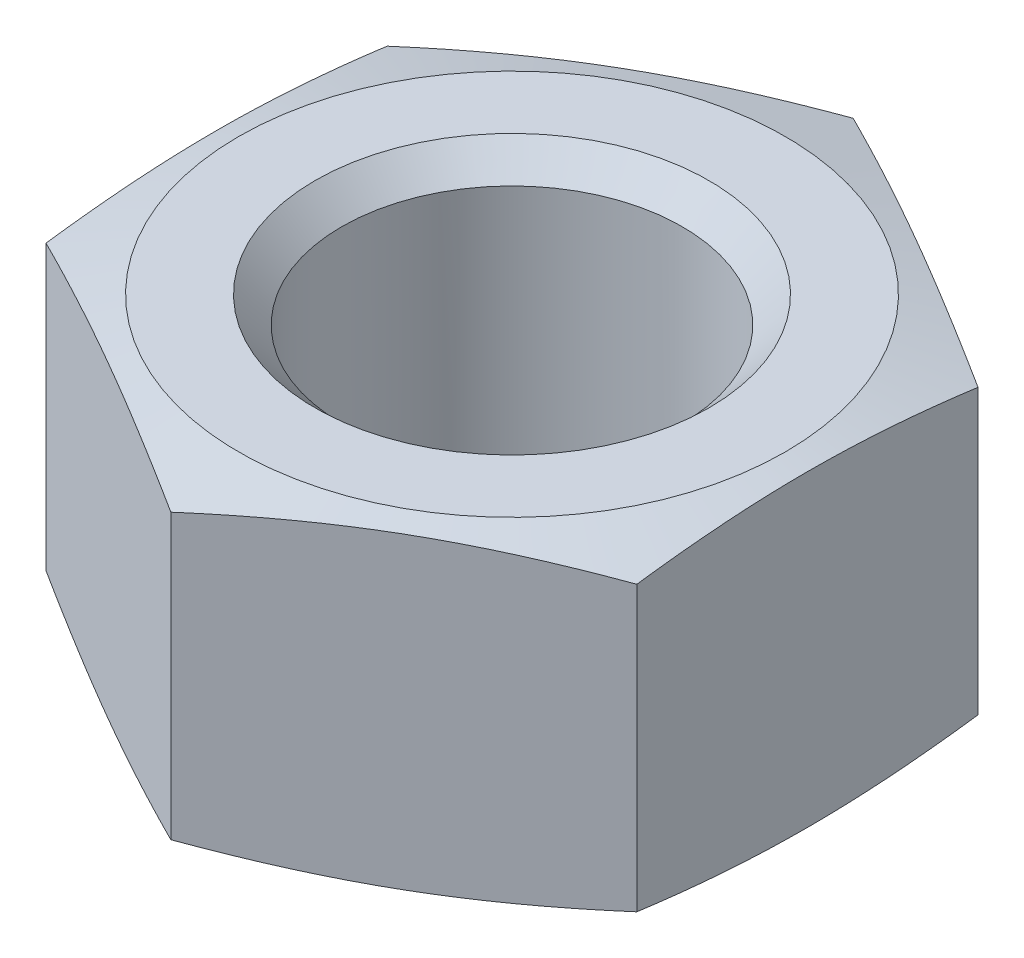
ISO-10303-21;
HEADER;
FILE_DESCRIPTION(('STEP AP214'),'2;1');
FILE_NAME('part.step','',(''),(''),'','','');
FILE_SCHEMA(('AUTOMOTIVE_DESIGN { 1 0 10303 214 1 1 1 1 }'));
ENDSEC;
DATA;
#1=APPLICATION_CONTEXT('core data for automotive mechanical design processes');
#2=APPLICATION_PROTOCOL_DEFINITION('international standard','automotive_design',2000,#1);
#3=PRODUCT_CONTEXT('',#1,'mechanical');
#4=PRODUCT('Part','Part','',(#3));
#5=PRODUCT_RELATED_PRODUCT_CATEGORY('part','',(#4));
#6=PRODUCT_DEFINITION_FORMATION('','',#4);
#7=PRODUCT_DEFINITION_CONTEXT('part definition',#1,'design');
#8=PRODUCT_DEFINITION('design','',#6,#7);
#9=PRODUCT_DEFINITION_SHAPE('','',#8);
#10=(LENGTH_UNIT() NAMED_UNIT(*) SI_UNIT(.MILLI.,.METRE.));
#11=(NAMED_UNIT(*) PLANE_ANGLE_UNIT() SI_UNIT($,.RADIAN.));
#12=(NAMED_UNIT(*) SI_UNIT($,.STERADIAN.) SOLID_ANGLE_UNIT());
#13=UNCERTAINTY_MEASURE_WITH_UNIT(LENGTH_MEASURE(1.E-05),#10,'distance_accuracy_value','');
#14=(GEOMETRIC_REPRESENTATION_CONTEXT(3) GLOBAL_UNCERTAINTY_ASSIGNED_CONTEXT((#13)) GLOBAL_UNIT_ASSIGNED_CONTEXT((#10,
#11,#12)) REPRESENTATION_CONTEXT('',''));
#15=CARTESIAN_POINT('',(0.,0.,0.));
#16=DIRECTION('',(0.,0.,1.));
#17=DIRECTION('',(1.,0.,0.));
#18=AXIS2_PLACEMENT_3D('',#15,#16,#17);
#19=CARTESIAN_POINT('',(12.,13.,-6.92820323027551));
#20=DIRECTION('',(-0.5,0.,0.866025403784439));
#21=DIRECTION('',(0.866025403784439,0.,0.5));
#22=AXIS2_PLACEMENT_3D('',#19,#20,#21);
#23=PLANE('',#22);
#24=CARTESIAN_POINT('',(11.9999999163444,12.261423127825,-6.9282032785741));
#25=CARTESIAN_POINT('',(11.5016700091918,12.3385442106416,-7.21591418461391));
#26=CARTESIAN_POINT('',(11.0024366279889,12.4085571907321,-7.50414671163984));
#27=CARTESIAN_POINT('',(10.0022069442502,12.5315631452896,-8.08162958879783));
#28=CARTESIAN_POINT('',(9.50121000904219,12.5845492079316,-8.37088030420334));
#29=CARTESIAN_POINT('',(8.50049047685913,12.670408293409,-8.94864599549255));
#30=CARTESIAN_POINT('',(8.00077464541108,12.7033836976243,-9.2371570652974));
#31=CARTESIAN_POINT('',(7.00070578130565,12.7476003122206,-9.81454709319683));
#32=CARTESIAN_POINT('',(6.50035289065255,12.758845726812,-10.1034259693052));
#33=CARTESIAN_POINT('',(5.49964710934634,12.758845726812,-10.681183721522));
#34=CARTESIAN_POINT('',(4.99929421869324,12.7476003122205,-10.9700625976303));
#35=CARTESIAN_POINT('',(3.99922535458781,12.7033836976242,-11.5474526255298));
#36=CARTESIAN_POINT('',(3.49950952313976,12.6704082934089,-11.8359636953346));
#37=CARTESIAN_POINT('',(2.49878999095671,12.5845492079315,-12.4137293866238));
#38=CARTESIAN_POINT('',(1.99779305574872,12.5315631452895,-12.7029801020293));
#39=CARTESIAN_POINT('',(0.997563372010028,12.4085571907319,-13.2804629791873));
#40=CARTESIAN_POINT('',(0.498329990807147,12.3385442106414,-13.5686955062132));
#41=CARTESIAN_POINT('',(8.36545068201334E-08,12.2614231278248,-13.8564064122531));
#42=B_SPLINE_CURVE_WITH_KNOTS('',3,(#24,#25,#26,#27,#28,#29,#30,#31,#32,#33,#34,#35,#36,#37,#38,
#39,#40,#41),.UNSPECIFIED.,.F.,.F.,(4,2,2,2,2,2,2,2,4),(0.,1.74179193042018,3.48429002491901,
5.21779603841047,6.95096662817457,8.68413721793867,10.4176432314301,12.160141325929,
13.9019332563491),.UNSPECIFIED.);
#43=CARTESIAN_POINT('',(12.,12.2614231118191,-6.92820325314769));
#44=VERTEX_POINT('',#43);
#45=CARTESIAN_POINT('',(4.18272539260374E-08,12.2614231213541,-13.856406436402));
#46=VERTEX_POINT('',#45);
#47=EDGE_CURVE('E256',#44,#46,#42,.T.);
#48=ORIENTED_EDGE('',*,*,#47,.F.);
#49=DIRECTION('',(0.,1.,0.));
#50=VECTOR('',#49,1.);
#51=CARTESIAN_POINT('',(12.,13.,-6.92820323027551));
#52=LINE('',#51,#50);
#53=CARTESIAN_POINT('',(11.9999999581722,0.738576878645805,-6.9282032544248));
#54=VERTEX_POINT('',#53);
#55=EDGE_CURVE('E96',#44,#54,#52,.F.);
#56=ORIENTED_EDGE('',*,*,#55,.T.);
#57=CARTESIAN_POINT('',(-5.67002062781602E-08,0.738576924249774,-13.8564064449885));
#58=CARTESIAN_POINT('',(0.498329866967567,0.661455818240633,-13.5686955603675));
#59=CARTESIAN_POINT('',(0.997563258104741,0.591442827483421,-13.280463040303));
#60=CARTESIAN_POINT('',(1.99779295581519,0.468436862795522,-12.7029801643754));
#61=CARTESIAN_POINT('',(2.49878989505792,0.415450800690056,-12.4137294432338));
#62=CARTESIAN_POINT('',(3.49950943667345,0.329591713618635,-11.8359637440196));
#63=CARTESIAN_POINT('',(3.99922527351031,0.296616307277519,-11.5474526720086));
#64=CARTESIAN_POINT('',(4.99929414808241,0.252399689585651,-10.9700626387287));
#65=CARTESIAN_POINT('',(5.49964704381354,0.241154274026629,-10.6811837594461));
#66=CARTESIAN_POINT('',(6.50035283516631,0.241154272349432,-10.1034260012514));
#67=CARTESIAN_POINT('',(7.00070573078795,0.25239968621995,-9.81454712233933));
#68=CARTESIAN_POINT('',(8.00077460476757,0.296616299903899,-9.23715708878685));
#69=CARTESIAN_POINT('',(8.50049044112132,0.329591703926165,-8.94864601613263));
#70=CARTESIAN_POINT('',(9.50120998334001,0.415450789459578,-8.37088031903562));
#71=CARTESIAN_POINT('',(10.0022069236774,0.468436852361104,-8.08162960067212));
#72=CARTESIAN_POINT('',(11.0024366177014,0.591442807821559,-7.50414671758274));
#73=CARTESIAN_POINT('',(11.5016700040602,0.661455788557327,-7.21591418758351));
#74=CARTESIAN_POINT('',(11.9999999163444,0.738576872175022,-6.92820327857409));
#75=B_SPLINE_CURVE_WITH_KNOTS('',3,(#57,#58,#59,#60,#61,#62,#63,#64,#65,#66,#67,#68,#69,#70,#71,
#72,#73,#74),.UNSPECIFIED.,.F.,.F.,(4,2,2,2,2,2,2,2,4),(0.,1.74179194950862,3.48429006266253,
5.21779609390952,6.95096670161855,8.68413730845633,10.4176433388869,12.1601414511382,
13.9019333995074),.UNSPECIFIED.);
#76=CARTESIAN_POINT('',(-4.18278041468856E-08,0.7385768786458,-13.8564064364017));
#77=VERTEX_POINT('',#76);
#78=EDGE_CURVE('E93',#77,#54,#75,.T.);
#79=ORIENTED_EDGE('',*,*,#78,.F.);
#80=DIRECTION('',(0.,1.,0.));
#81=VECTOR('',#80,1.);
#82=CARTESIAN_POINT('',(0.,13.,-13.856406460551));
#83=LINE('',#82,#81);
#84=EDGE_CURVE('E80',#77,#46,#83,.T.);
#85=ORIENTED_EDGE('',*,*,#84,.T.);
#86=EDGE_LOOP('',(#48,#56,#79,#85));
#87=FACE_BOUND('',#86,.T.);
#88=ADVANCED_FACE('F16',(#87),#23,.F.);
#89=CARTESIAN_POINT('',(0.,13.,-13.856406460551));
#90=DIRECTION('',(0.5,0.,0.866025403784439));
#91=DIRECTION('',(0.866025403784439,0.,-0.5));
#92=AXIS2_PLACEMENT_3D('',#89,#90,#91);
#93=PLANE('',#92);
#94=CARTESIAN_POINT('',(3.96146779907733E-08,12.261423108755,-13.8564064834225));
#95=CARTESIAN_POINT('',(-0.498329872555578,12.3385441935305,-13.5686955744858));
#96=CARTESIAN_POINT('',(-0.997563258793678,12.4085571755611,-13.2804630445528));
#97=CARTESIAN_POINT('',(-1.9977929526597,12.5315631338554,-12.7029801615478));
#98=CARTESIAN_POINT('',(-2.49878989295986,12.5845491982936,-12.4137294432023));
#99=CARTESIAN_POINT('',(-3.49950943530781,12.6704082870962,-11.8359637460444));
#100=CARTESIAN_POINT('',(-3.99922527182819,12.7033836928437,-11.547452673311));
#101=CARTESIAN_POINT('',(-4.99929414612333,12.7476003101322,-10.9700626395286));
#102=CARTESIAN_POINT('',(-5.4996470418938,12.7588457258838,-10.6811837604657));
#103=CARTESIAN_POINT('',(-6.50035283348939,12.7588457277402,-10.1034260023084));
#104=CARTESIAN_POINT('',(-7.00070572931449,12.7476003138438,-9.81454712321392));
#105=CARTESIAN_POINT('',(-8.00077460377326,12.7033837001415,-9.23715708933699));
#106=CARTESIAN_POINT('',(-8.50049044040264,12.6704082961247,-8.9486460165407));
#107=CARTESIAN_POINT('',(-9.5012099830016,12.5845492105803,-8.37088031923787));
#108=CARTESIAN_POINT('',(-10.002206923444,12.5315631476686,-8.0816296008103));
#109=CARTESIAN_POINT('',(-11.0024366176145,12.4085571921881,-7.50414671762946));
#110=CARTESIAN_POINT('',(-11.5016700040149,12.3385442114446,-7.21591418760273));
#111=CARTESIAN_POINT('',(-11.9999999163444,12.261423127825,-6.92820327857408));
#112=B_SPLINE_CURVE_WITH_KNOTS('',3,(#94,#95,#96,#97,#98,#99,#100,#101,#102,#103,#104,#105,#106,
#107,#108,#109,#110,#111),.UNSPECIFIED.,.F.,.F.,(4,2,2,2,2,2,2,2,4),(0.,1.7417919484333,
3.48429006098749,5.217796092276,6.95096669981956,8.6841373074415,10.4176433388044,
12.1601414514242,13.9019333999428),.UNSPECIFIED.);
#113=CARTESIAN_POINT('',(-11.9999999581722,12.2614231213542,-6.9282032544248));
#114=VERTEX_POINT('',#113);
#115=EDGE_CURVE('E83',#46,#114,#112,.T.);
#116=ORIENTED_EDGE('',*,*,#115,.F.);
#117=ORIENTED_EDGE('',*,*,#84,.F.);
#118=CARTESIAN_POINT('',(-11.9999999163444,0.738576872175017,-6.92820327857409));
#119=CARTESIAN_POINT('',(-11.5016700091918,0.661455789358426,-7.21591418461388));
#120=CARTESIAN_POINT('',(-11.002436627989,0.59144280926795,-7.50414671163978));
#121=CARTESIAN_POINT('',(-10.0022069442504,0.468436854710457,-8.08162958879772));
#122=CARTESIAN_POINT('',(-9.5012100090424,0.415450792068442,-8.3708803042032));
#123=CARTESIAN_POINT('',(-8.50049047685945,0.329591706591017,-8.94864599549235));
#124=CARTESIAN_POINT('',(-8.00077464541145,0.296616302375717,-9.23715706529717));
#125=CARTESIAN_POINT('',(-7.00070578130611,0.252399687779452,-9.81454709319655));
#126=CARTESIAN_POINT('',(-6.50035289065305,0.241154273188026,-10.1034259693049));
#127=CARTESIAN_POINT('',(-5.49964710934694,0.241154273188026,-10.6811837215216));
#128=CARTESIAN_POINT('',(-4.99929421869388,0.252399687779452,-10.9700625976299));
#129=CARTESIAN_POINT('',(-3.99922535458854,0.296616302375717,-11.5474526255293));
#130=CARTESIAN_POINT('',(-3.49950952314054,0.329591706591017,-11.8359636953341));
#131=CARTESIAN_POINT('',(-2.49878999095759,0.415450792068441,-12.4137293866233));
#132=CARTESIAN_POINT('',(-1.99779305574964,0.468436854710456,-12.7029801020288));
#133=CARTESIAN_POINT('',(-0.997563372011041,0.591442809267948,-13.2804629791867));
#134=CARTESIAN_POINT('',(-0.498329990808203,0.661455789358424,-13.5686955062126));
#135=CARTESIAN_POINT('',(-8.36556066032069E-08,0.738576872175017,-13.8564064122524));
#136=B_SPLINE_CURVE_WITH_KNOTS('',3,(#118,#119,#120,#121,#122,#123,#124,#125,#126,#127,#128,
#129,#130,#131,#132,#133,#134,#135),.UNSPECIFIED.,.F.,.F.,(4,2,2,2,2,2,2,2,4),(0.,
1.74179193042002,3.48429002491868,5.21779603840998,6.95096662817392,8.68413721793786,
10.4176432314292,12.1601413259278,13.9019332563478),.UNSPECIFIED.);
#137=CARTESIAN_POINT('',(-12.,0.738576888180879,-6.92820325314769));
#138=VERTEX_POINT('',#137);
#139=EDGE_CURVE('E20',#138,#77,#136,.T.);
#140=ORIENTED_EDGE('',*,*,#139,.F.);
#141=DIRECTION('',(0.,1.,0.));
#142=VECTOR('',#141,1.);
#143=CARTESIAN_POINT('',(-12.,13.,-6.92820323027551));
#144=LINE('',#143,#142);
#145=EDGE_CURVE('E73',#138,#114,#144,.T.);
#146=ORIENTED_EDGE('',*,*,#145,.T.);
#147=EDGE_LOOP('',(#116,#117,#140,#146));
#148=FACE_BOUND('',#147,.T.);
#149=ADVANCED_FACE('F82',(#148),#93,.F.);
#150=CARTESIAN_POINT('',(-12.,13.,-6.92820323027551));
#151=DIRECTION('',(1.,0.,0.));
#152=DIRECTION('',(0.,0.,-1.));
#153=AXIS2_PLACEMENT_3D('',#150,#151,#152);
#154=PLANE('',#153);
#155=CARTESIAN_POINT('',(-12.,12.2614231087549,-6.92820327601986));
#156=CARTESIAN_POINT('',(-12.,12.3385441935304,-6.35278145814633));
#157=CARTESIAN_POINT('',(-12.,12.408557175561,-5.77631639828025));
#158=CARTESIAN_POINT('',(-12.,12.5315631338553,-4.62135063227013));
#159=CARTESIAN_POINT('',(-12.,12.5845491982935,-4.04284919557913));
#160=CARTESIAN_POINT('',(-12.,12.6704082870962,-2.88731780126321));
#161=CARTESIAN_POINT('',(-12.,12.7033836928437,-2.31029565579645));
#162=CARTESIAN_POINT('',(-12.,12.7476003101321,-1.15551558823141));
#163=CARTESIAN_POINT('',(-12.,12.7588457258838,-0.577757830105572));
#164=CARTESIAN_POINT('',(-12.,12.7588457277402,0.577757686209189));
#165=CARTESIAN_POINT('',(-12.,12.7476003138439,1.15551544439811));
#166=CARTESIAN_POINT('',(-12.,12.7033837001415,2.31029551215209));
#167=CARTESIAN_POINT('',(-12.,12.6704082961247,2.88731765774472));
#168=CARTESIAN_POINT('',(-12.,12.5845492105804,4.04284905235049));
#169=CARTESIAN_POINT('',(-12.,12.5315631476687,4.62135048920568));
#170=CARTESIAN_POINT('',(-12.,12.4085571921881,5.77631625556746));
#171=CARTESIAN_POINT('',(-12.,12.3385442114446,6.35278131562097));
#172=CARTESIAN_POINT('',(-12.,12.261423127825,6.92820313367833));
#173=B_SPLINE_CURVE_WITH_KNOTS('',3,(#155,#156,#157,#158,#159,#160,#161,#162,#163,#164,#165,
#166,#167,#168,#169,#170,#171,#172),.UNSPECIFIED.,.F.,.F.,(4,2,2,2,2,2,2,2,4),(0.,
1.74179194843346,3.4842900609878,5.21779609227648,6.95096669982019,8.68413730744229,
10.4176433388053,12.1601414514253,13.9019333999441),.UNSPECIFIED.);
#174=CARTESIAN_POINT('',(-12.,12.2614231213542,6.92820318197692));
#175=VERTEX_POINT('',#174);
#176=EDGE_CURVE('E170',#114,#175,#173,.T.);
#177=ORIENTED_EDGE('',*,*,#176,.F.);
#178=ORIENTED_EDGE('',*,*,#145,.F.);
#179=CARTESIAN_POINT('',(-11.9999999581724,0.738576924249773,6.92820327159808));
#180=CARTESIAN_POINT('',(-11.9999999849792,0.661455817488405,6.35278145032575));
#181=CARTESIAN_POINT('',(-11.9999999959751,0.591442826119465,5.77631638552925));
#182=CARTESIAN_POINT('',(-12.0000000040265,0.468436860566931,4.62135060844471));
#183=CARTESIAN_POINT('',(-12.0000000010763,0.415450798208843,4.04284916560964));
#184=CARTESIAN_POINT('',(-11.9999999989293,0.329591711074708,2.8873177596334));
#185=CARTESIAN_POINT('',(-11.9999999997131,0.29661630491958,2.31029560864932));
#186=CARTESIAN_POINT('',(-12.0000000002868,0.252399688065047,1.15551552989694));
#187=CARTESIAN_POINT('',(-12.0000000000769,0.241154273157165,0.577757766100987));
#188=CARTESIAN_POINT('',(-11.9999999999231,0.241154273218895,-0.577757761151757));
#189=CARTESIAN_POINT('',(-11.9999999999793,0.252399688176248,-1.15551552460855));
#190=CARTESIAN_POINT('',(-12.0000000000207,0.296616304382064,-2.31029560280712));
#191=CARTESIAN_POINT('',(-12.0000000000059,0.329591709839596,-2.88731775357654));
#192=CARTESIAN_POINT('',(-11.999999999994,0.415450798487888,-4.04284915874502));
#193=CARTESIAN_POINT('',(-11.999999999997,0.468436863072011,-4.62135060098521));
#194=CARTESIAN_POINT('',(-12.000000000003,0.59144282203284,-5.7763163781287));
#195=CARTESIAN_POINT('',(-12.000000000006,0.661455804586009,-6.35278144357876));
#196=CARTESIAN_POINT('',(-12.,0.738576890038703,-6.92820326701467));
#197=B_SPLINE_CURVE_WITH_KNOTS('',3,(#179,#180,#181,#182,#183,#184,#185,#186,#187,#188,#189,
#190,#191,#192,#193,#194,#195,#196),.UNSPECIFIED.,.F.,.F.,(4,2,2,2,2,2,2,2,4),(0.,
1.74179196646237,3.48429009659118,5.21779614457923,6.95096676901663,8.68413739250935,
10.4176434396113,12.160141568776,13.9019335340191),.UNSPECIFIED.);
#198=CARTESIAN_POINT('',(-11.9999999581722,0.738576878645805,6.92820325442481));
#199=VERTEX_POINT('',#198);
#200=EDGE_CURVE('E95',#199,#138,#197,.T.);
#201=ORIENTED_EDGE('',*,*,#200,.F.);
#202=DIRECTION('',(0.,1.,0.));
#203=VECTOR('',#202,1.);
#204=CARTESIAN_POINT('',(-12.,13.,6.92820323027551));
#205=LINE('',#204,#203);
#206=EDGE_CURVE('E237',#199,#175,#205,.T.);
#207=ORIENTED_EDGE('',*,*,#206,.T.);
#208=EDGE_LOOP('',(#177,#178,#201,#207));
#209=FACE_BOUND('',#208,.T.);
#210=ADVANCED_FACE('F180',(#209),#154,.F.);
#211=CARTESIAN_POINT('',(-12.,13.,6.92820323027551));
#212=DIRECTION('',(0.5,0.,-0.866025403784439));
#213=DIRECTION('',(-0.866025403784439,0.,-0.5));
#214=AXIS2_PLACEMENT_3D('',#211,#212,#213);
#215=PLANE('',#214);
#216=CARTESIAN_POINT('',(-12.0000000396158,12.2614231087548,6.92820320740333));
#217=CARTESIAN_POINT('',(-11.5016701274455,12.3385441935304,7.21591411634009));
#218=CARTESIAN_POINT('',(-11.0024367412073,12.408557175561,7.50414664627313));
#219=CARTESIAN_POINT('',(-10.0022070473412,12.5315631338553,8.08162952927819));
#220=CARTESIAN_POINT('',(-9.50121010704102,12.5845491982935,8.37088024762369));
#221=CARTESIAN_POINT('',(-8.50049056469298,12.6704082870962,8.94864594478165));
#222=CARTESIAN_POINT('',(-8.00077472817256,12.7033836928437,9.23715701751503));
#223=CARTESIAN_POINT('',(-7.00070585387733,12.7476003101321,9.81454705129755));
#224=CARTESIAN_POINT('',(-6.50035295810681,12.7588457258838,10.1034259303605));
#225=CARTESIAN_POINT('',(-5.49964716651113,12.7588457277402,10.6811836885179));
#226=CARTESIAN_POINT('',(-4.99929427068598,12.7476003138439,10.9700625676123));
#227=CARTESIAN_POINT('',(-3.99922539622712,12.7033837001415,11.5474526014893));
#228=CARTESIAN_POINT('',(-3.4995095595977,12.6704082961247,11.8359636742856));
#229=CARTESIAN_POINT('',(-2.49879001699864,12.5845492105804,12.4137293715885));
#230=CARTESIAN_POINT('',(-1.99779307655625,12.5315631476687,12.7029800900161));
#231=CARTESIAN_POINT('',(-0.997563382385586,12.4085571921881,13.280462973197));
#232=CARTESIAN_POINT('',(-0.498329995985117,12.3385442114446,13.5686955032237));
#233=CARTESIAN_POINT('',(-8.36556147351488E-08,12.261423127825,13.8564064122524));
#234=B_SPLINE_CURVE_WITH_KNOTS('',3,(#216,#217,#218,#219,#220,#221,#222,#223,#224,#225,#226,
#227,#228,#229,#230,#231,#232,#233),.UNSPECIFIED.,.F.,.F.,(4,2,2,2,2,2,2,2,4),(0.,
1.74179194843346,3.4842900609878,5.21779609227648,6.95096669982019,8.6841373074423,
10.4176433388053,12.1601414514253,13.9019333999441),.UNSPECIFIED.);
#235=CARTESIAN_POINT('',(-4.1827805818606E-08,12.2614231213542,13.8564064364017));
#236=VERTEX_POINT('',#235);
#237=EDGE_CURVE('E159',#175,#236,#234,.T.);
#238=ORIENTED_EDGE('',*,*,#237,.F.);
#239=ORIENTED_EDGE('',*,*,#206,.F.);
#240=CARTESIAN_POINT('',(5.66989519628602E-08,0.738576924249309,13.8564064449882));
#241=CARTESIAN_POINT('',(-0.49832986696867,0.661455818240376,13.5686955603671));
#242=CARTESIAN_POINT('',(-0.997563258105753,0.59144282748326,13.2804630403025));
#243=CARTESIAN_POINT('',(-1.99779295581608,0.468436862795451,12.7029801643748));
#244=CARTESIAN_POINT('',(-2.49878989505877,0.415450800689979,12.4137294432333));
#245=CARTESIAN_POINT('',(-3.49950943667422,0.329591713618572,11.8359637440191));
#246=CARTESIAN_POINT('',(-3.99922527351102,0.296616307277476,11.5474526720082));
#247=CARTESIAN_POINT('',(-4.99929414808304,0.252399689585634,10.9700626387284));
#248=CARTESIAN_POINT('',(-5.49964704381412,0.241154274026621,10.6811837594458));
#249=CARTESIAN_POINT('',(-6.5003528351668,0.241154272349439,10.1034260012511));
#250=CARTESIAN_POINT('',(-7.0007057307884,0.252399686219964,9.81454712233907));
#251=CARTESIAN_POINT('',(-8.00077460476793,0.296616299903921,9.23715708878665));
#252=CARTESIAN_POINT('',(-8.50049044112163,0.329591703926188,8.94864601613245));
#253=CARTESIAN_POINT('',(-9.50120998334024,0.415450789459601,8.37088031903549));
#254=CARTESIAN_POINT('',(-10.0022069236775,0.468436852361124,8.08162960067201));
#255=CARTESIAN_POINT('',(-11.0024366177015,0.591442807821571,7.50414671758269));
#256=CARTESIAN_POINT('',(-11.5016700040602,0.661455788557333,7.21591418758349));
#257=CARTESIAN_POINT('',(-11.9999999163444,0.738576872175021,6.9282032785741));
#258=B_SPLINE_CURVE_WITH_KNOTS('',3,(#240,#241,#242,#243,#244,#245,#246,#247,#248,#249,#250,
#251,#252,#253,#254,#255,#256,#257),.UNSPECIFIED.,.F.,.F.,(4,2,2,2,2,2,2,2,4),(0.,
1.74179194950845,3.4842900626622,5.21779609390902,6.95096670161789,8.68413730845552,
10.4176433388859,12.1601414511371,13.9019333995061),.UNSPECIFIED.);
#259=CARTESIAN_POINT('',(4.18272533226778E-08,0.738576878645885,13.856406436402));
#260=VERTEX_POINT('',#259);
#261=EDGE_CURVE('E133',#260,#199,#258,.T.);
#262=ORIENTED_EDGE('',*,*,#261,.F.);
#263=DIRECTION('',(0.,1.,0.));
#264=VECTOR('',#263,1.);
#265=CARTESIAN_POINT('',(0.,13.,13.856406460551));
#266=LINE('',#265,#264);
#267=EDGE_CURVE('E240',#260,#236,#266,.T.);
#268=ORIENTED_EDGE('',*,*,#267,.T.);
#269=EDGE_LOOP('',(#238,#239,#262,#268));
#270=FACE_BOUND('',#269,.T.);
#271=ADVANCED_FACE('F147',(#270),#215,.F.);
#272=CARTESIAN_POINT('',(0.,13.,13.856406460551));
#273=DIRECTION('',(-0.5,0.,-0.866025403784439));
#274=DIRECTION('',(-0.866025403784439,0.,0.5));
#275=AXIS2_PLACEMENT_3D('',#272,#273,#274);
#276=PLANE('',#275);
#277=CARTESIAN_POINT('',(-3.9615782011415E-08,12.2614231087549,13.8564064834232));
#278=CARTESIAN_POINT('',(0.498329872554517,12.3385441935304,13.5686955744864));
#279=CARTESIAN_POINT('',(0.997563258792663,12.408557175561,13.2804630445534));
#280=CARTESIAN_POINT('',(1.99779295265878,12.5315631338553,12.7029801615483));
#281=CARTESIAN_POINT('',(2.49878989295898,12.5845491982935,12.4137294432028));
#282=CARTESIAN_POINT('',(3.49950943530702,12.6704082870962,11.8359637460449));
#283=CARTESIAN_POINT('',(3.99922527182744,12.7033836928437,11.5474526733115));
#284=CARTESIAN_POINT('',(4.99929414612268,12.7476003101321,10.970062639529));
#285=CARTESIAN_POINT('',(5.4996470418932,12.7588457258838,10.681183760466));
#286=CARTESIAN_POINT('',(6.50035283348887,12.7588457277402,10.1034260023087));
#287=CARTESIAN_POINT('',(7.00070572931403,12.7476003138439,9.81454712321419));
#288=CARTESIAN_POINT('',(8.00077460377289,12.7033837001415,9.2371570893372));
#289=CARTESIAN_POINT('',(8.50049044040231,12.6704082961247,8.94864601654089));
#290=CARTESIAN_POINT('',(9.50120998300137,12.5845492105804,8.370880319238));
#291=CARTESIAN_POINT('',(10.0022069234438,12.5315631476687,8.0816296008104));
#292=CARTESIAN_POINT('',(11.0024366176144,12.4085571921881,7.50414671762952));
#293=CARTESIAN_POINT('',(11.5016700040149,12.3385442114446,7.21591418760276));
#294=CARTESIAN_POINT('',(11.9999999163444,12.261423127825,6.92820327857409));
#295=B_SPLINE_CURVE_WITH_KNOTS('',3,(#277,#278,#279,#280,#281,#282,#283,#284,#285,#286,#287,
#288,#289,#290,#291,#292,#293,#294),.UNSPECIFIED.,.F.,.F.,(4,2,2,2,2,2,2,2,4),(0.,
1.74179194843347,3.48429006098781,5.21779609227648,6.9509666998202,8.68413730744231,
10.4176433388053,12.1601414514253,13.9019333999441),.UNSPECIFIED.);
#296=CARTESIAN_POINT('',(11.9999999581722,12.2614231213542,6.9282032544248));
#297=VERTEX_POINT('',#296);
#298=EDGE_CURVE('E40',#236,#297,#295,.T.);
#299=ORIENTED_EDGE('',*,*,#298,.F.);
#300=ORIENTED_EDGE('',*,*,#267,.F.);
#301=CARTESIAN_POINT('',(12.0000000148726,0.738576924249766,6.92820317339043));
#302=CARTESIAN_POINT('',(11.5016701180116,0.661455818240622,7.21591410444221));
#303=CARTESIAN_POINT('',(11.0024367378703,0.591442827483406,7.50414664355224));
#304=CARTESIAN_POINT('',(10.0022070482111,0.4684368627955,8.08162953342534));
#305=CARTESIAN_POINT('',(9.50121010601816,0.41545080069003,8.37088024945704));
#306=CARTESIAN_POINT('',(8.50049056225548,0.329591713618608,8.94864594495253));
#307=CARTESIAN_POINT('',(8.00077472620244,0.296616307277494,9.2371570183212));
#308=CARTESIAN_POINT('',(7.00070585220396,0.252399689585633,9.81454705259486));
#309=CARTESIAN_POINT('',(6.50035295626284,0.241154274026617,10.1034259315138));
#310=CARTESIAN_POINT('',(5.49964716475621,0.241154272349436,10.6811836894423));
#311=CARTESIAN_POINT('',(4.9992942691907,0.252399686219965,10.9700625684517));
#312=CARTESIAN_POINT('',(3.99922539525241,0.296616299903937,11.5474526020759));
#313=CARTESIAN_POINT('',(3.49950955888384,0.329591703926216,11.8359636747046));
#314=CARTESIAN_POINT('',(2.49879001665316,0.415450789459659,12.4137293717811));
#315=CARTESIAN_POINT('',(1.99779307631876,0.4684368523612,12.7029800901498));
#316=CARTESIAN_POINT('',(0.99756338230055,0.591442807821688,13.2804629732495));
#317=CARTESIAN_POINT('',(0.498329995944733,0.661455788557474,13.5686955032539));
#318=CARTESIAN_POINT('',(8.36545053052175E-08,0.738576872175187,13.856406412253));
#319=B_SPLINE_CURVE_WITH_KNOTS('',3,(#301,#302,#303,#304,#305,#306,#307,#308,#309,#310,#311,
#312,#313,#314,#315,#316,#317,#318),.UNSPECIFIED.,.F.,.F.,(4,2,2,2,2,2,2,2,4),(0.,
1.74179194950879,3.48429006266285,5.21779609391,6.95096670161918,8.68413730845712,
10.4176433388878,12.1601414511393,13.9019333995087),.UNSPECIFIED.);
#320=CARTESIAN_POINT('',(12.,0.738576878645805,6.92820318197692));
#321=VERTEX_POINT('',#320);
#322=EDGE_CURVE('E99',#321,#260,#319,.T.);
#323=ORIENTED_EDGE('',*,*,#322,.F.);
#324=DIRECTION('',(0.,1.,0.));
#325=VECTOR('',#324,1.);
#326=CARTESIAN_POINT('',(12.,13.,6.92820323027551));
#327=LINE('',#326,#325);
#328=EDGE_CURVE('E243',#321,#297,#327,.T.);
#329=ORIENTED_EDGE('',*,*,#328,.T.);
#330=EDGE_LOOP('',(#299,#300,#323,#329));
#331=FACE_BOUND('',#330,.T.);
#332=ADVANCED_FACE('F144',(#331),#276,.F.);
#333=CARTESIAN_POINT('',(12.,13.,6.92820323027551));
#334=DIRECTION('',(-1.,0.,0.));
#335=DIRECTION('',(0.,0.,1.));
#336=AXIS2_PLACEMENT_3D('',#333,#334,#335);
#337=PLANE('',#336);
#338=CARTESIAN_POINT('',(12.,12.2614231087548,6.92820327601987));
#339=CARTESIAN_POINT('',(12.,12.3385441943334,6.35278145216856));
#340=CARTESIAN_POINT('',(12.,12.4085571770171,5.77631638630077));
#341=CARTESIAN_POINT('',(12.,12.5315631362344,4.62135060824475));
#342=CARTESIAN_POINT('',(12.,12.5845492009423,4.04284916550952));
#343=CARTESIAN_POINT('',(12.,12.6704082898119,2.88731775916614));
#344=CARTESIAN_POINT('',(12.,12.7033836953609,2.31029560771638));
#345=CARTESIAN_POINT('',(12.,12.7476003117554,1.15551552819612));
#346=CARTESIAN_POINT('',(12.,12.758845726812,0.57775776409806));
#347=CARTESIAN_POINT('',(12.,12.758845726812,-0.57775776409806));
#348=CARTESIAN_POINT('',(12.,12.7476003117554,-1.15551552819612));
#349=CARTESIAN_POINT('',(12.,12.7033836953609,-2.31029560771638));
#350=CARTESIAN_POINT('',(12.,12.6704082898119,-2.88731775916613));
#351=CARTESIAN_POINT('',(12.,12.5845492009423,-4.04284916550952));
#352=CARTESIAN_POINT('',(12.,12.5315631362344,-4.62135060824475));
#353=CARTESIAN_POINT('',(12.,12.4085571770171,-5.77631638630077));
#354=CARTESIAN_POINT('',(12.,12.3385441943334,-6.35278145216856));
#355=CARTESIAN_POINT('',(12.,12.2614231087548,-6.92820327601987));
#356=B_SPLINE_CURVE_WITH_KNOTS('',3,(#338,#339,#340,#341,#342,#343,#344,#345,#346,#347,#348,
#349,#350,#351,#352,#353,#354,#355),.UNSPECIFIED.,.F.,.F.,(4,2,2,2,2,2,2,2,4),(0.,
1.74179196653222,3.48429009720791,5.2177961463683,6.95096677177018,8.68413739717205,
10.4176434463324,12.1601415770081,13.9019335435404),.UNSPECIFIED.);
#357=EDGE_CURVE('E158',#297,#44,#356,.T.);
#358=ORIENTED_EDGE('',*,*,#357,.F.);
#359=ORIENTED_EDGE('',*,*,#328,.F.);
#360=CARTESIAN_POINT('',(11.9999999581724,0.738576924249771,-6.92820327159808));
#361=CARTESIAN_POINT('',(11.9999999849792,0.661455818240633,-6.35278145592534));
#362=CARTESIAN_POINT('',(11.9999999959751,0.591442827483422,-5.77631639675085));
#363=CARTESIAN_POINT('',(12.0000000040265,0.468436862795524,-4.62135063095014));
#364=CARTESIAN_POINT('',(12.0000000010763,0.415450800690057,-4.04284919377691));
#365=CARTESIAN_POINT('',(11.9999999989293,0.329591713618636,-2.88731779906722));
#366=CARTESIAN_POINT('',(11.9999999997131,0.29661630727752,-2.31029565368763));
#367=CARTESIAN_POINT('',(12.0000000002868,0.252399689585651,-1.15551558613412));
#368=CARTESIAN_POINT('',(12.0000000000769,0.241154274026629,-0.577757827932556));
#369=CARTESIAN_POINT('',(11.9999999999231,0.241154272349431,0.5777576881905));
#370=CARTESIAN_POINT('',(11.9999999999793,0.25239968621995,1.15551544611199));
#371=CARTESIAN_POINT('',(12.0000000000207,0.296616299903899,2.31029551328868));
#372=CARTESIAN_POINT('',(12.0000000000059,0.329591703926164,2.88731765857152));
#373=CARTESIAN_POINT('',(11.999999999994,0.415450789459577,4.04284905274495));
#374=CARTESIAN_POINT('',(11.999999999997,0.468436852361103,4.62135048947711));
#375=CARTESIAN_POINT('',(12.000000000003,0.591442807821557,5.77631625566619));
#376=CARTESIAN_POINT('',(12.000000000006,0.661455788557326,6.35278131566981));
#377=CARTESIAN_POINT('',(12.,0.738576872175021,6.92820313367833));
#378=B_SPLINE_CURVE_WITH_KNOTS('',3,(#360,#361,#362,#363,#364,#365,#366,#367,#368,#369,#370,
#371,#372,#373,#374,#375,#376,#377),.UNSPECIFIED.,.F.,.F.,(4,2,2,2,2,2,2,2,4),(0.,
1.74179194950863,3.48429006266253,5.21779609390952,6.95096670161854,8.68413730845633,
10.4176433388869,12.1601414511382,13.9019333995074),.UNSPECIFIED.);
#379=EDGE_CURVE('E98',#54,#321,#378,.T.);
#380=ORIENTED_EDGE('',*,*,#379,.F.);
#381=ORIENTED_EDGE('',*,*,#55,.F.);
#382=EDGE_LOOP('',(#358,#359,#380,#381));
#383=FACE_BOUND('',#382,.T.);
#384=ADVANCED_FACE('F115',(#383),#337,.F.);
#385=CARTESIAN_POINT('',(0.,0.743008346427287,0.));
#386=DIRECTION('',(0.,1.,0.));
#387=DIRECTION('',(-1.,0.,0.));
#388=AXIS2_PLACEMENT_3D('',#385,#386,#387);
#389=CONICAL_SURFACE('',#388,13.8729448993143,1.30899693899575);
#390=ORIENTED_EDGE('',*,*,#261,.T.);
#391=ORIENTED_EDGE('',*,*,#200,.T.);
#392=ORIENTED_EDGE('',*,*,#139,.T.);
#393=ORIENTED_EDGE('',*,*,#78,.T.);
#394=ORIENTED_EDGE('',*,*,#379,.T.);
#395=ORIENTED_EDGE('',*,*,#322,.T.);
#396=EDGE_LOOP('',(#390,#391,#392,#393,#394,#395));
#397=FACE_BOUND('',#396,.T.);
#398=CARTESIAN_POINT('',(0.,0.,0.));
#399=DIRECTION('',(0.,1.,0.));
#400=DIRECTION('',(-1.,0.,0.));
#401=AXIS2_PLACEMENT_3D('',#398,#399,#400);
#402=CIRCLE('',#401,11.1);
#403=CARTESIAN_POINT('',(-11.1,0.,0.));
#404=VERTEX_POINT('',#403);
#405=EDGE_CURVE('E227',#404,#404,#402,.T.);
#406=ORIENTED_EDGE('',*,*,#405,.T.);
#407=EDGE_LOOP('',(#406));
#408=FACE_BOUND('',#407,.T.);
#409=ADVANCED_FACE('F90',(#397,#408),#389,.T.);
#410=CARTESIAN_POINT('',(0.,12.2569916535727,0.));
#411=DIRECTION('',(0.,-1.,0.));
#412=DIRECTION('',(1.,0.,0.));
#413=AXIS2_PLACEMENT_3D('',#410,#411,#412);
#414=CONICAL_SURFACE('',#413,13.8729448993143,1.30899693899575);
#415=CARTESIAN_POINT('',(0.,13.,0.));
#416=DIRECTION('',(0.,-1.,0.));
#417=DIRECTION('',(1.,0.,0.));
#418=AXIS2_PLACEMENT_3D('',#415,#416,#417);
#419=CIRCLE('',#418,11.1);
#420=CARTESIAN_POINT('',(11.1,13.,0.));
#421=VERTEX_POINT('',#420);
#422=EDGE_CURVE('E228',#421,#421,#419,.F.);
#423=ORIENTED_EDGE('',*,*,#422,.F.);
#424=EDGE_LOOP('',(#423));
#425=FACE_BOUND('',#424,.T.);
#426=ORIENTED_EDGE('',*,*,#298,.T.);
#427=ORIENTED_EDGE('',*,*,#357,.T.);
#428=ORIENTED_EDGE('',*,*,#47,.T.);
#429=ORIENTED_EDGE('',*,*,#115,.T.);
#430=ORIENTED_EDGE('',*,*,#176,.T.);
#431=ORIENTED_EDGE('',*,*,#237,.T.);
#432=EDGE_LOOP('',(#426,#427,#428,#429,#430,#431));
#433=FACE_BOUND('',#432,.T.);
#434=ADVANCED_FACE('F114',(#425,#433),#414,.T.);
#435=CARTESIAN_POINT('',(0.,0.,0.));
#436=DIRECTION('',(0.,1.,0.));
#437=DIRECTION('',(0.,0.,1.));
#438=AXIS2_PLACEMENT_3D('',#435,#436,#437);
#439=PLANE('',#438);
#440=CARTESIAN_POINT('',(0.,5.6843418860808E-11,0.));
#441=DIRECTION('',(0.,-1.,0.));
#442=DIRECTION('',(0.,0.,-1.));
#443=AXIS2_PLACEMENT_3D('',#440,#441,#442);
#444=CIRCLE('',#443,7.99999999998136);
#445=CARTESIAN_POINT('',(0.,5.6843418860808E-11,-7.99999999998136));
#446=VERTEX_POINT('',#445);
#447=EDGE_CURVE('E224',#446,#446,#444,.F.);
#448=ORIENTED_EDGE('',*,*,#447,.T.);
#449=EDGE_LOOP('',(#448));
#450=FACE_BOUND('',#449,.T.);
#451=ORIENTED_EDGE('',*,*,#405,.F.);
#452=EDGE_LOOP('',(#451));
#453=FACE_BOUND('',#452,.T.);
#454=ADVANCED_FACE('F212',(#450,#453),#439,.F.);
#455=CARTESIAN_POINT('',(0.,13.,0.));
#456=DIRECTION('',(0.,1.,0.));
#457=DIRECTION('',(0.,0.,1.));
#458=AXIS2_PLACEMENT_3D('',#455,#456,#457);
#459=PLANE('',#458);
#460=CARTESIAN_POINT('',(0.,13.,0.));
#461=DIRECTION('',(0.,1.,0.));
#462=DIRECTION('',(-1.,0.,0.));
#463=AXIS2_PLACEMENT_3D('',#460,#461,#462);
#464=CIRCLE('',#463,8.);
#465=CARTESIAN_POINT('',(-8.,13.,0.));
#466=VERTEX_POINT('',#465);
#467=EDGE_CURVE('E233',#466,#466,#464,.F.);
#468=ORIENTED_EDGE('',*,*,#467,.T.);
#469=EDGE_LOOP('',(#468));
#470=FACE_BOUND('',#469,.T.);
#471=ORIENTED_EDGE('',*,*,#422,.T.);
#472=EDGE_LOOP('',(#471));
#473=FACE_BOUND('',#472,.T.);
#474=ADVANCED_FACE('F209',(#470,#473),#459,.T.);
#475=CARTESIAN_POINT('',(0.,5.6843418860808E-11,0.));
#476=DIRECTION('',(0.,-1.,0.));
#477=DIRECTION('',(0.,0.,-1.));
#478=AXIS2_PLACEMENT_3D('',#475,#476,#477);
#479=CONICAL_SURFACE('',#478,7.99999999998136,0.785398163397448);
#480=CARTESIAN_POINT('',(0.,1.0825,0.));
#481=DIRECTION('',(0.,1.,0.));
#482=DIRECTION('',(0.,0.,1.));
#483=AXIS2_PLACEMENT_3D('',#480,#481,#482);
#484=CIRCLE('',#483,6.9175);
#485=CARTESIAN_POINT('',(0.,1.0825,6.9175));
#486=VERTEX_POINT('',#485);
#487=EDGE_CURVE('E31',#486,#486,#484,.T.);
#488=ORIENTED_EDGE('',*,*,#487,.T.);
#489=EDGE_LOOP('',(#488));
#490=FACE_BOUND('',#489,.T.);
#491=ORIENTED_EDGE('',*,*,#447,.F.);
#492=EDGE_LOOP('',(#491));
#493=FACE_BOUND('',#492,.T.);
#494=ADVANCED_FACE('F201',(#490,#493),#479,.F.);
#495=CARTESIAN_POINT('',(0.,13.,0.));
#496=DIRECTION('',(0.,1.,0.));
#497=DIRECTION('',(-1.,0.,0.));
#498=AXIS2_PLACEMENT_3D('',#495,#496,#497);
#499=CONICAL_SURFACE('',#498,8.,0.785398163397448);
#500=ORIENTED_EDGE('',*,*,#467,.F.);
#501=EDGE_LOOP('',(#500));
#502=FACE_BOUND('',#501,.T.);
#503=CARTESIAN_POINT('',(0.,11.9175,0.));
#504=DIRECTION('',(0.,1.,0.));
#505=DIRECTION('',(0.,0.,1.));
#506=AXIS2_PLACEMENT_3D('',#503,#504,#505);
#507=CIRCLE('',#506,6.9175);
#508=CARTESIAN_POINT('',(0.,11.9175,6.9175));
#509=VERTEX_POINT('',#508);
#510=EDGE_CURVE('E11',#509,#509,#507,.F.);
#511=ORIENTED_EDGE('',*,*,#510,.T.);
#512=EDGE_LOOP('',(#511));
#513=FACE_BOUND('',#512,.T.);
#514=ADVANCED_FACE('F194',(#502,#513),#499,.F.);
#515=CARTESIAN_POINT('',(0.,0.,0.));
#516=DIRECTION('',(0.,1.,0.));
#517=DIRECTION('',(0.,0.,1.));
#518=AXIS2_PLACEMENT_3D('',#515,#516,#517);
#519=CYLINDRICAL_SURFACE('',#518,6.9175);
#520=ORIENTED_EDGE('',*,*,#510,.F.);
#521=EDGE_LOOP('',(#520));
#522=FACE_BOUND('',#521,.T.);
#523=ORIENTED_EDGE('',*,*,#487,.F.);
#524=EDGE_LOOP('',(#523));
#525=FACE_BOUND('',#524,.T.);
#526=ADVANCED_FACE('F192',(#522,#525),#519,.F.);
#527=CLOSED_SHELL('',(#88,#149,#210,#271,#332,#384,#409,#434,#454,#474,#494,#514,#526));
#528=MANIFOLD_SOLID_BREP('B1',#527);
#529=ADVANCED_BREP_SHAPE_REPRESENTATION('',(#18,#528),#14);
#530=SHAPE_DEFINITION_REPRESENTATION(#9,#529);
ENDSEC;
END-ISO-10303-21;
